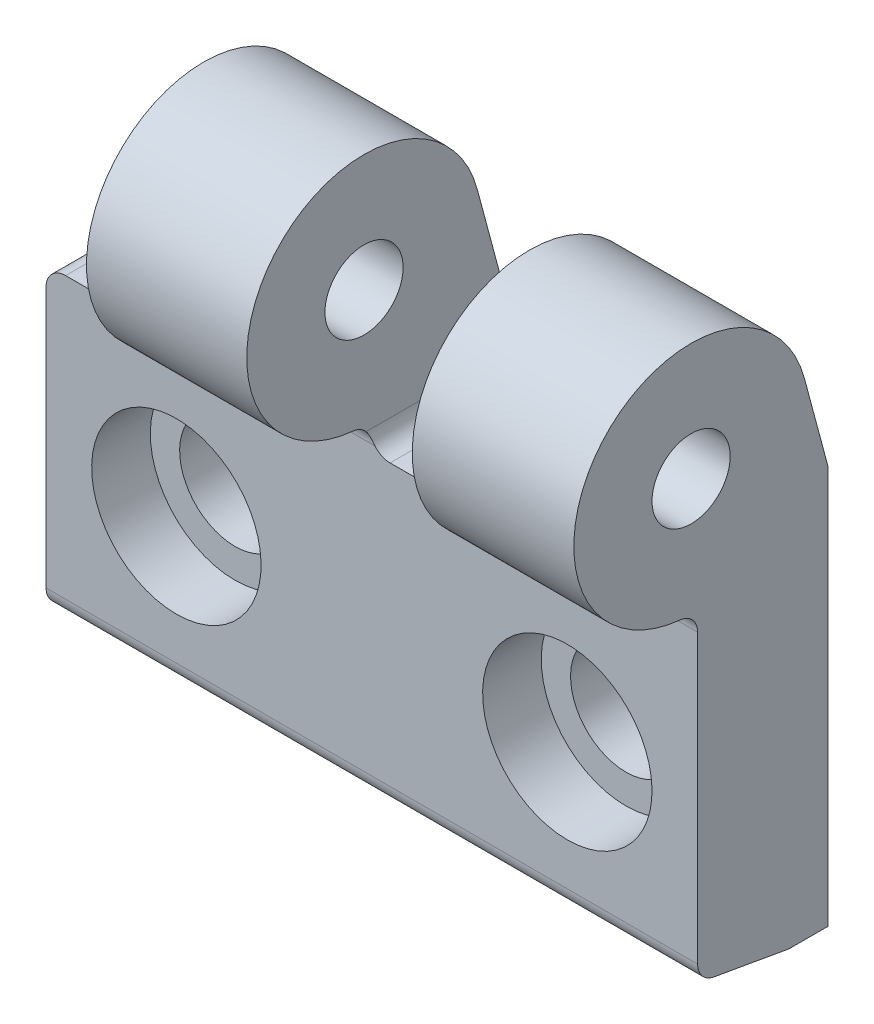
ISO-10303-21;
HEADER;
FILE_DESCRIPTION(('STEP AP214'),'2;1');
FILE_NAME('part.step','',(''),(''),'','','');
FILE_SCHEMA(('AUTOMOTIVE_DESIGN { 1 0 10303 214 1 1 1 1 }'));
ENDSEC;
DATA;
#1=APPLICATION_CONTEXT('core data for automotive mechanical design processes');
#2=APPLICATION_PROTOCOL_DEFINITION('international standard','automotive_design',2000,#1);
#3=PRODUCT_CONTEXT('',#1,'mechanical');
#4=PRODUCT('Part','Part','',(#3));
#5=PRODUCT_RELATED_PRODUCT_CATEGORY('part','',(#4));
#6=PRODUCT_DEFINITION_FORMATION('','',#4);
#7=PRODUCT_DEFINITION_CONTEXT('part definition',#1,'design');
#8=PRODUCT_DEFINITION('design','',#6,#7);
#9=PRODUCT_DEFINITION_SHAPE('','',#8);
#10=(LENGTH_UNIT() NAMED_UNIT(*) SI_UNIT(.MILLI.,.METRE.));
#11=(NAMED_UNIT(*) PLANE_ANGLE_UNIT() SI_UNIT($,.RADIAN.));
#12=(NAMED_UNIT(*) SI_UNIT($,.STERADIAN.) SOLID_ANGLE_UNIT());
#13=UNCERTAINTY_MEASURE_WITH_UNIT(LENGTH_MEASURE(1.E-05),#10,'distance_accuracy_value','');
#14=(GEOMETRIC_REPRESENTATION_CONTEXT(3) GLOBAL_UNCERTAINTY_ASSIGNED_CONTEXT((#13)) GLOBAL_UNIT_ASSIGNED_CONTEXT((#10,
#11,#12)) REPRESENTATION_CONTEXT('',''));
#15=CARTESIAN_POINT('',(0.,0.,0.));
#16=DIRECTION('',(0.,0.,1.));
#17=DIRECTION('',(1.,0.,0.));
#18=AXIS2_PLACEMENT_3D('',#15,#16,#17);
#19=CARTESIAN_POINT('',(40.,22.750000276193,10.5000324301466));
#20=DIRECTION('',(1.,0.,0.));
#21=DIRECTION('',(0.,1.,0.));
#22=AXIS2_PLACEMENT_3D('',#19,#20,#21);
#23=PLANE('',#22);
#24=DIRECTION('',(0.,0.,-1.));
#25=VECTOR('',#24,1.);
#26=CARTESIAN_POINT('',(40.,-12.25,3.));
#27=LINE('',#26,#25);
#28=CARTESIAN_POINT('',(40.,-12.25,3.));
#29=VERTEX_POINT('',#28);
#30=CARTESIAN_POINT('',(40.,-12.25,0.));
#31=VERTEX_POINT('',#30);
#32=EDGE_CURVE('E241',#29,#31,#27,.T.);
#33=ORIENTED_EDGE('',*,*,#32,.T.);
#34=DIRECTION('',(0.,1.,0.));
#35=VECTOR('',#34,1.);
#36=CARTESIAN_POINT('',(40.,-12.25,0.));
#37=LINE('',#36,#35);
#38=CARTESIAN_POINT('',(40.,18.3364567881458,0.));
#39=VERTEX_POINT('',#38);
#40=EDGE_CURVE('E242',#31,#39,#37,.T.);
#41=ORIENTED_EDGE('',*,*,#40,.T.);
#42=DIRECTION('',(0.,0.965927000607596,0.258814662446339));
#43=VECTOR('',#42,1.);
#44=CARTESIAN_POINT('',(40.,18.3364567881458,0.));
#45=LINE('',#44,#43);
#46=CARTESIAN_POINT('',(40.,25.0793174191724,1.806711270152));
#47=VERTEX_POINT('',#46);
#48=EDGE_CURVE('E245',#39,#47,#45,.T.);
#49=ORIENTED_EDGE('',*,*,#48,.T.);
#50=CARTESIAN_POINT('',(40.,22.750000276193,10.5000324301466));
#51=DIRECTION('',(1.,0.,0.));
#52=DIRECTION('',(0.,-1.,0.));
#53=AXIS2_PLACEMENT_3D('',#50,#51,#52);
#54=CIRCLE('',#53,8.99997506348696);
#55=CARTESIAN_POINT('',(40.,13.7909299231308,11.3571260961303));
#56=VERTEX_POINT('',#55);
#57=EDGE_CURVE('E248',#47,#56,#54,.T.);
#58=ORIENTED_EDGE('',*,*,#57,.T.);
#59=CARTESIAN_POINT('',(40.,12.2978016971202,11.499942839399));
#60=DIRECTION('',(-1.,0.,0.));
#61=DIRECTION('',(0.,1.,0.));
#62=AXIS2_PLACEMENT_3D('',#59,#60,#61);
#63=CIRCLE('',#62,1.4999428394);
#64=CARTESIAN_POINT('',(40.,12.2978,10.));
#65=VERTEX_POINT('',#64);
#66=EDGE_CURVE('E251',#56,#65,#63,.T.);
#67=ORIENTED_EDGE('',*,*,#66,.T.);
#68=DIRECTION('',(0.,-1.,0.));
#69=VECTOR('',#68,1.);
#70=CARTESIAN_POINT('',(40.,12.2978,10.));
#71=LINE('',#70,#69);
#72=CARTESIAN_POINT('',(40.,-9.7568,10.));
#73=VERTEX_POINT('',#72);
#74=EDGE_CURVE('E254',#65,#73,#71,.T.);
#75=ORIENTED_EDGE('',*,*,#74,.T.);
#76=CARTESIAN_POINT('',(40.,-9.75672678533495,8.49992708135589));
#77=DIRECTION('',(1.,0.,0.));
#78=DIRECTION('',(0.,1.,0.));
#79=AXIS2_PLACEMENT_3D('',#76,#77,#78);
#80=CIRCLE('',#79,1.50007292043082);
#81=CARTESIAN_POINT('',(40.,-11.233987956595,8.7605382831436));
#82=VERTEX_POINT('',#81);
#83=EDGE_CURVE('E257',#73,#82,#80,.T.);
#84=ORIENTED_EDGE('',*,*,#83,.T.);
#85=DIRECTION('',(0.,-0.173693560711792,-0.984799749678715));
#86=VECTOR('',#85,1.);
#87=CARTESIAN_POINT('',(40.,-11.233987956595,8.7605382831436));
#88=LINE('',#87,#86);
#89=EDGE_CURVE('E260',#82,#29,#88,.T.);
#90=ORIENTED_EDGE('',*,*,#89,.T.);
#91=EDGE_LOOP('',(#33,#41,#49,#58,#67,#75,#84,#90));
#92=FACE_BOUND('',#91,.T.);
#93=CARTESIAN_POINT('',(40.,22.75,10.5));
#94=DIRECTION('',(1.,0.,0.));
#95=DIRECTION('',(0.,1.,0.));
#96=AXIS2_PLACEMENT_3D('',#93,#94,#95);
#97=CIRCLE('',#96,3.);
#98=CARTESIAN_POINT('',(40.,25.75,10.5));
#99=VERTEX_POINT('',#98);
#100=EDGE_CURVE('E317',#99,#99,#97,.T.);
#101=ORIENTED_EDGE('',*,*,#100,.F.);
#102=EDGE_LOOP('',(#101));
#103=FACE_BOUND('',#102,.T.);
#104=ADVANCED_FACE('F14',(#92,#103),#23,.T.);
#105=CARTESIAN_POINT('',(27.6,13.25,35.5));
#106=DIRECTION('',(-1.,0.,0.));
#107=DIRECTION('',(0.,-1.,0.));
#108=AXIS2_PLACEMENT_3D('',#105,#106,#107);
#109=PLANE('',#108);
#110=CARTESIAN_POINT('',(27.6,22.750000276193,10.5000324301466));
#111=DIRECTION('',(-1.,0.,0.));
#112=DIRECTION('',(0.,-1.,0.));
#113=AXIS2_PLACEMENT_3D('',#110,#111,#112);
#114=CIRCLE('',#113,8.99997506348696);
#115=CARTESIAN_POINT('',(27.6,25.0793174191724,1.806711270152));
#116=VERTEX_POINT('',#115);
#117=CARTESIAN_POINT('',(27.6,13.7909299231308,11.3571260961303));
#118=VERTEX_POINT('',#117);
#119=EDGE_CURVE('E233',#116,#118,#114,.F.);
#120=ORIENTED_EDGE('',*,*,#119,.F.);
#121=DIRECTION('',(0.,-0.965927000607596,-0.258814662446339));
#122=VECTOR('',#121,1.);
#123=CARTESIAN_POINT('',(27.6,18.3364567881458,0.));
#124=LINE('',#123,#122);
#125=CARTESIAN_POINT('',(27.6,18.3364567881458,0.));
#126=VERTEX_POINT('',#125);
#127=EDGE_CURVE('E159',#116,#126,#124,.T.);
#128=ORIENTED_EDGE('',*,*,#127,.T.);
#129=DIRECTION('',(0.,-1.,0.));
#130=VECTOR('',#129,1.);
#131=CARTESIAN_POINT('',(27.6,-12.25,0.));
#132=LINE('',#131,#130);
#133=CARTESIAN_POINT('',(27.6,13.25,0.));
#134=VERTEX_POINT('',#133);
#135=EDGE_CURVE('E153',#126,#134,#132,.T.);
#136=ORIENTED_EDGE('',*,*,#135,.T.);
#137=DIRECTION('',(0.,0.,1.));
#138=VECTOR('',#137,1.);
#139=CARTESIAN_POINT('',(27.6,13.25,-14.5));
#140=LINE('',#139,#138);
#141=CARTESIAN_POINT('',(27.6,13.25,10.341000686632));
#142=VERTEX_POINT('',#141);
#143=EDGE_CURVE('E157',#134,#142,#140,.T.);
#144=ORIENTED_EDGE('',*,*,#143,.T.);
#145=CARTESIAN_POINT('',(27.6,12.2978016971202,11.499942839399));
#146=DIRECTION('',(-1.,0.,0.));
#147=DIRECTION('',(0.,-1.,0.));
#148=AXIS2_PLACEMENT_3D('',#145,#146,#147);
#149=CIRCLE('',#148,1.4999428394);
#150=EDGE_CURVE('E294',#118,#142,#149,.T.);
#151=ORIENTED_EDGE('',*,*,#150,.F.);
#152=EDGE_LOOP('',(#120,#128,#136,#144,#151));
#153=FACE_BOUND('',#152,.T.);
#154=CARTESIAN_POINT('',(27.6,22.75,10.5));
#155=DIRECTION('',(-1.,0.,0.));
#156=DIRECTION('',(0.,-1.,0.));
#157=AXIS2_PLACEMENT_3D('',#154,#155,#156);
#158=CIRCLE('',#157,3.);
#159=CARTESIAN_POINT('',(27.6,19.75,10.5));
#160=VERTEX_POINT('',#159);
#161=EDGE_CURVE('E18',#160,#160,#158,.F.);
#162=ORIENTED_EDGE('',*,*,#161,.T.);
#163=EDGE_LOOP('',(#162));
#164=FACE_BOUND('',#163,.T.);
#165=ADVANCED_FACE('F155',(#153,#164),#109,.T.);
#166=CARTESIAN_POINT('',(-10.,22.750000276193,10.5000324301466));
#167=DIRECTION('',(1.,0.,0.));
#168=DIRECTION('',(0.,1.,0.));
#169=AXIS2_PLACEMENT_3D('',#166,#167,#168);
#170=CYLINDRICAL_SURFACE('',#169,8.99997506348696);
#171=DIRECTION('',(1.,0.,0.));
#172=VECTOR('',#171,1.);
#173=CARTESIAN_POINT('',(-10.,25.0793174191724,1.806711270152));
#174=LINE('',#173,#172);
#175=CARTESIAN_POINT('',(2.6,25.0793174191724,1.806711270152));
#176=VERTEX_POINT('',#175);
#177=CARTESIAN_POINT('',(14.9,25.0793174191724,1.806711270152));
#178=VERTEX_POINT('',#177);
#179=EDGE_CURVE('E288',#176,#178,#174,.T.);
#180=ORIENTED_EDGE('',*,*,#179,.F.);
#181=CARTESIAN_POINT('',(2.6,22.750000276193,10.5000324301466));
#182=DIRECTION('',(-1.,0.,0.));
#183=DIRECTION('',(0.,-1.,0.));
#184=AXIS2_PLACEMENT_3D('',#181,#182,#183);
#185=CIRCLE('',#184,8.99997506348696);
#186=CARTESIAN_POINT('',(2.6,13.7909299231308,11.3571260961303));
#187=VERTEX_POINT('',#186);
#188=EDGE_CURVE('E238',#176,#187,#185,.F.);
#189=ORIENTED_EDGE('',*,*,#188,.T.);
#190=DIRECTION('',(1.,0.,0.));
#191=VECTOR('',#190,1.);
#192=CARTESIAN_POINT('',(-10.,13.7909299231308,11.3571260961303));
#193=LINE('',#192,#191);
#194=CARTESIAN_POINT('',(14.9,13.7909299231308,11.3571260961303));
#195=VERTEX_POINT('',#194);
#196=EDGE_CURVE('E285',#187,#195,#193,.T.);
#197=ORIENTED_EDGE('',*,*,#196,.T.);
#198=CARTESIAN_POINT('',(14.9,22.750000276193,10.5000324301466));
#199=DIRECTION('',(1.,0.,0.));
#200=DIRECTION('',(0.,1.,0.));
#201=AXIS2_PLACEMENT_3D('',#198,#199,#200);
#202=CIRCLE('',#201,8.99997506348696);
#203=EDGE_CURVE('E236',#195,#178,#202,.F.);
#204=ORIENTED_EDGE('',*,*,#203,.T.);
#205=EDGE_LOOP('',(#180,#189,#197,#204));
#206=FACE_BOUND('',#205,.T.);
#207=ADVANCED_FACE('F397',(#206),#170,.T.);
#208=CARTESIAN_POINT('',(-10.,12.2978016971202,11.499942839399));
#209=DIRECTION('',(1.,0.,0.));
#210=DIRECTION('',(0.,1.,0.));
#211=AXIS2_PLACEMENT_3D('',#208,#209,#210);
#212=CYLINDRICAL_SURFACE('',#211,1.4999428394);
#213=CARTESIAN_POINT('',(2.25901473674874,12.2978,10.));
#214=CARTESIAN_POINT('',(2.2797627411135,12.3230526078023,10.0000001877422));
#215=CARTESIAN_POINT('',(2.29967758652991,12.3489793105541,10.0006386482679));
#216=CARTESIAN_POINT('',(2.33775095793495,12.4020375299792,10.003389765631));
#217=CARTESIAN_POINT('',(2.35590848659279,12.4291697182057,10.0055032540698));
#218=CARTESIAN_POINT('',(2.40746237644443,12.5119325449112,10.0143326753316));
#219=CARTESIAN_POINT('',(2.43807845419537,12.5690984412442,10.0235349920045));
#220=CARTESIAN_POINT('',(2.49127515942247,12.6856590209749,10.0497775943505));
#221=CARTESIAN_POINT('',(2.51381870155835,12.7450626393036,10.0668532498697));
#222=CARTESIAN_POINT('',(2.55066148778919,12.8634480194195,10.1093233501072));
#223=CARTESIAN_POINT('',(2.56496299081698,12.9224298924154,10.1347155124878));
#224=CARTESIAN_POINT('',(2.58420664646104,13.0275705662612,10.1884093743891));
#225=CARTESIAN_POINT('',(2.59034341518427,13.0741764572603,10.215438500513));
#226=CARTESIAN_POINT('',(2.59825353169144,13.1645032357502,10.2745439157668));
#227=CARTESIAN_POINT('',(2.6000251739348,13.2082229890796,10.3066221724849));
#228=CARTESIAN_POINT('',(2.6,13.25,10.341000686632));
#229=B_SPLINE_CURVE_WITH_KNOTS('',3,(#213,#214,#215,#216,#217,#218,#219,#220,#221,#222,#223,
#224,#225,#226,#227,#228),.UNSPECIFIED.,.F.,.F.,(4,2,2,2,2,2,2,4),(0.,0.0980045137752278,
0.196064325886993,0.391536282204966,0.587895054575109,0.7841999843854,0.946388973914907,
1.10864132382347),.UNSPECIFIED.);
#230=CARTESIAN_POINT('',(2.25901473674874,12.2978,10.));
#231=VERTEX_POINT('',#230);
#232=CARTESIAN_POINT('',(2.6,13.25,10.341000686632));
#233=VERTEX_POINT('',#232);
#234=EDGE_CURVE('E222',#231,#233,#229,.T.);
#235=ORIENTED_EDGE('',*,*,#234,.F.);
#236=DIRECTION('',(1.,0.,0.));
#237=VECTOR('',#236,1.);
#238=CARTESIAN_POINT('',(-10.,12.2978,10.));
#239=LINE('',#238,#237);
#240=CARTESIAN_POINT('',(15.2409852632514,12.2978,10.));
#241=VERTEX_POINT('',#240);
#242=EDGE_CURVE('E282',#231,#241,#239,.T.);
#243=ORIENTED_EDGE('',*,*,#242,.T.);
#244=CARTESIAN_POINT('',(14.9,13.25,10.341000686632));
#245=CARTESIAN_POINT('',(14.9000002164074,13.2247480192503,10.320251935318));
#246=CARTESIAN_POINT('',(14.900638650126,13.1988218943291,10.300336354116));
#247=CARTESIAN_POINT('',(14.9033896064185,13.1457647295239,10.2622615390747));
#248=CARTESIAN_POINT('',(14.9055029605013,13.1186330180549,10.2441033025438));
#249=CARTESIAN_POINT('',(14.9143318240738,13.0358714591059,10.1925473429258));
#250=CARTESIAN_POINT('',(14.9235335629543,12.9787061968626,10.1619299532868));
#251=CARTESIAN_POINT('',(14.9497746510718,12.8621464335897,10.1087308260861));
#252=CARTESIAN_POINT('',(14.9668493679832,12.8027429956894,10.0861861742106));
#253=CARTESIAN_POINT('',(15.0093173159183,12.6843575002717,10.0493414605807));
#254=CARTESIAN_POINT('',(15.0347082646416,12.6253753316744,10.0350391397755));
#255=CARTESIAN_POINT('',(15.0883997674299,12.520233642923,10.0157943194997));
#256=CARTESIAN_POINT('',(15.1154277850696,12.4736271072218,10.0096571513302));
#257=CARTESIAN_POINT('',(15.1745309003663,12.3832987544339,10.0017465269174));
#258=CARTESIAN_POINT('',(15.2066079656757,12.3395780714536,9.99997477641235));
#259=CARTESIAN_POINT('',(15.2409852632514,12.2978,10.));
#260=B_SPLINE_CURVE_WITH_KNOTS('',3,(#244,#245,#246,#247,#248,#249,#250,#251,#252,#253,#254,
#255,#256,#257,#258,#259),.UNSPECIFIED.,.F.,.F.,(4,2,2,2,2,2,2,4),(0.,0.0980044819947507,
0.19606426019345,0.391536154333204,0.587894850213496,0.784199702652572,0.946388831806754,
1.10864132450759),.UNSPECIFIED.);
#261=CARTESIAN_POINT('',(14.9,13.25,10.341000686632));
#262=VERTEX_POINT('',#261);
#263=EDGE_CURVE('E182',#262,#241,#260,.T.);
#264=ORIENTED_EDGE('',*,*,#263,.F.);
#265=CARTESIAN_POINT('',(14.9,12.2978016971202,11.499942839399));
#266=DIRECTION('',(1.,0.,0.));
#267=DIRECTION('',(0.,1.,0.));
#268=AXIS2_PLACEMENT_3D('',#265,#266,#267);
#269=CIRCLE('',#268,1.4999428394);
#270=EDGE_CURVE('E296',#262,#195,#269,.T.);
#271=ORIENTED_EDGE('',*,*,#270,.T.);
#272=ORIENTED_EDGE('',*,*,#196,.F.);
#273=CARTESIAN_POINT('',(2.6,12.2978016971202,11.499942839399));
#274=DIRECTION('',(-1.,0.,0.));
#275=DIRECTION('',(0.,-1.,0.));
#276=AXIS2_PLACEMENT_3D('',#273,#274,#275);
#277=CIRCLE('',#276,1.4999428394);
#278=EDGE_CURVE('E299',#187,#233,#277,.T.);
#279=ORIENTED_EDGE('',*,*,#278,.T.);
#280=EDGE_LOOP('',(#235,#243,#264,#271,#272,#279));
#281=FACE_BOUND('',#280,.T.);
#282=ADVANCED_FACE('F407',(#281),#212,.F.);
#283=CARTESIAN_POINT('',(-10.,18.3364567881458,0.));
#284=DIRECTION('',(0.,0.258814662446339,-0.965927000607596));
#285=DIRECTION('',(0.,0.965927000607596,0.258814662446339));
#286=AXIS2_PLACEMENT_3D('',#283,#284,#285);
#287=PLANE('',#286);
#288=DIRECTION('',(0.,-0.965927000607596,-0.258814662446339));
#289=VECTOR('',#288,1.);
#290=CARTESIAN_POINT('',(2.6,18.3364567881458,0.));
#291=LINE('',#290,#289);
#292=CARTESIAN_POINT('',(2.6,18.3364567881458,0.));
#293=VERTEX_POINT('',#292);
#294=EDGE_CURVE('E350',#176,#293,#291,.T.);
#295=ORIENTED_EDGE('',*,*,#294,.F.);
#296=ORIENTED_EDGE('',*,*,#179,.T.);
#297=DIRECTION('',(0.,0.965927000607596,0.258814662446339));
#298=VECTOR('',#297,1.);
#299=CARTESIAN_POINT('',(14.9,18.3364567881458,0.));
#300=LINE('',#299,#298);
#301=CARTESIAN_POINT('',(14.9,18.3364567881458,0.));
#302=VERTEX_POINT('',#301);
#303=EDGE_CURVE('E163',#302,#178,#300,.T.);
#304=ORIENTED_EDGE('',*,*,#303,.F.);
#305=DIRECTION('',(1.,0.,0.));
#306=VECTOR('',#305,1.);
#307=CARTESIAN_POINT('',(-10.,18.3364567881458,0.));
#308=LINE('',#307,#306);
#309=EDGE_CURVE('E291',#293,#302,#308,.T.);
#310=ORIENTED_EDGE('',*,*,#309,.F.);
#311=EDGE_LOOP('',(#295,#296,#304,#310));
#312=FACE_BOUND('',#311,.T.);
#313=ADVANCED_FACE('F394',(#312),#287,.T.);
#314=EDGE_CURVE('E286',#116,#47,#174,.T.);
#315=ORIENTED_EDGE('',*,*,#314,.F.);
#316=ORIENTED_EDGE('',*,*,#119,.T.);
#317=EDGE_CURVE('E283',#118,#56,#193,.T.);
#318=ORIENTED_EDGE('',*,*,#317,.T.);
#319=ORIENTED_EDGE('',*,*,#57,.F.);
#320=EDGE_LOOP('',(#315,#316,#318,#319));
#321=FACE_BOUND('',#320,.T.);
#322=ADVANCED_FACE('F419',(#321),#170,.T.);
#323=CARTESIAN_POINT('',(27.2590147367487,12.2978,10.));
#324=CARTESIAN_POINT('',(27.2797627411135,12.3230526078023,10.0000001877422));
#325=CARTESIAN_POINT('',(27.2996775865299,12.3489793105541,10.0006386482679));
#326=CARTESIAN_POINT('',(27.3377509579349,12.4020375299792,10.003389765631));
#327=CARTESIAN_POINT('',(27.3559084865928,12.4291697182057,10.0055032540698));
#328=CARTESIAN_POINT('',(27.4074623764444,12.5119325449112,10.0143326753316));
#329=CARTESIAN_POINT('',(27.4380784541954,12.5690984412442,10.0235349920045));
#330=CARTESIAN_POINT('',(27.4912751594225,12.6856590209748,10.0497775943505));
#331=CARTESIAN_POINT('',(27.5138187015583,12.7450626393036,10.0668532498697));
#332=CARTESIAN_POINT('',(27.5506614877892,12.8634480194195,10.1093233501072));
#333=CARTESIAN_POINT('',(27.564962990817,12.9224298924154,10.1347155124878));
#334=CARTESIAN_POINT('',(27.5842066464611,13.0275705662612,10.1884093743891));
#335=CARTESIAN_POINT('',(27.5903434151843,13.0741764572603,10.215438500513));
#336=CARTESIAN_POINT('',(27.5982535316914,13.1645032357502,10.2745439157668));
#337=CARTESIAN_POINT('',(27.6000251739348,13.2082229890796,10.3066221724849));
#338=CARTESIAN_POINT('',(27.6,13.25,10.341000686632));
#339=B_SPLINE_CURVE_WITH_KNOTS('',3,(#323,#324,#325,#326,#327,#328,#329,#330,#331,#332,#333,
#334,#335,#336,#337,#338),.UNSPECIFIED.,.F.,.F.,(4,2,2,2,2,2,2,4),(0.,0.0980045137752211,
0.196064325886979,0.391536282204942,0.587895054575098,0.784199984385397,0.946388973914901,
1.10864132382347),.UNSPECIFIED.);
#340=CARTESIAN_POINT('',(27.2590147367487,12.2978,10.));
#341=VERTEX_POINT('',#340);
#342=EDGE_CURVE('E172',#341,#142,#339,.T.);
#343=ORIENTED_EDGE('',*,*,#342,.F.);
#344=EDGE_CURVE('E280',#341,#65,#239,.T.);
#345=ORIENTED_EDGE('',*,*,#344,.T.);
#346=ORIENTED_EDGE('',*,*,#66,.F.);
#347=ORIENTED_EDGE('',*,*,#317,.F.);
#348=ORIENTED_EDGE('',*,*,#150,.T.);
#349=EDGE_LOOP('',(#343,#345,#346,#347,#348));
#350=FACE_BOUND('',#349,.T.);
#351=ADVANCED_FACE('F202',(#350),#212,.F.);
#352=CARTESIAN_POINT('',(-10.,-12.25,3.));
#353=DIRECTION('',(0.,-1.,0.));
#354=DIRECTION('',(1.,0.,0.));
#355=AXIS2_PLACEMENT_3D('',#352,#353,#354);
#356=PLANE('',#355);
#357=DIRECTION('',(1.,0.,0.));
#358=VECTOR('',#357,1.);
#359=CARTESIAN_POINT('',(-10.,-12.25,0.));
#360=LINE('',#359,#358);
#361=CARTESIAN_POINT('',(-10.,-12.25,0.));
#362=VERTEX_POINT('',#361);
#363=EDGE_CURVE('E292',#362,#31,#360,.T.);
#364=ORIENTED_EDGE('',*,*,#363,.T.);
#365=ORIENTED_EDGE('',*,*,#32,.F.);
#366=DIRECTION('',(1.,0.,0.));
#367=VECTOR('',#366,1.);
#368=CARTESIAN_POINT('',(-10.,-12.25,3.));
#369=LINE('',#368,#367);
#370=CARTESIAN_POINT('',(-10.,-12.25,3.));
#371=VERTEX_POINT('',#370);
#372=EDGE_CURVE('E31',#371,#29,#369,.T.);
#373=ORIENTED_EDGE('',*,*,#372,.F.);
#374=DIRECTION('',(0.,0.,-1.));
#375=VECTOR('',#374,1.);
#376=CARTESIAN_POINT('',(-10.,-12.25,3.));
#377=LINE('',#376,#375);
#378=EDGE_CURVE('E263',#371,#362,#377,.T.);
#379=ORIENTED_EDGE('',*,*,#378,.T.);
#380=EDGE_LOOP('',(#364,#365,#373,#379));
#381=FACE_BOUND('',#380,.T.);
#382=ADVANCED_FACE('F16',(#381),#356,.T.);
#383=CARTESIAN_POINT('',(-10.,-12.25,0.));
#384=DIRECTION('',(0.,0.,-1.));
#385=DIRECTION('',(-1.,0.,0.));
#386=AXIS2_PLACEMENT_3D('',#383,#384,#385);
#387=PLANE('',#386);
#388=CARTESIAN_POINT('',(0.,0.,0.));
#389=DIRECTION('',(0.,0.,1.));
#390=DIRECTION('',(0.,-1.,0.));
#391=AXIS2_PLACEMENT_3D('',#388,#389,#390);
#392=CIRCLE('',#391,4.25);
#393=CARTESIAN_POINT('',(0.,-4.25,0.));
#394=VERTEX_POINT('',#393);
#395=EDGE_CURVE('E959',#394,#394,#392,.T.);
#396=ORIENTED_EDGE('',*,*,#395,.T.);
#397=EDGE_LOOP('',(#396));
#398=FACE_BOUND('',#397,.T.);
#399=CARTESIAN_POINT('',(30.,0.,0.));
#400=DIRECTION('',(0.,0.,1.));
#401=DIRECTION('',(0.,-1.,0.));
#402=AXIS2_PLACEMENT_3D('',#399,#400,#401);
#403=CIRCLE('',#402,4.25);
#404=CARTESIAN_POINT('',(30.,-4.25,0.));
#405=VERTEX_POINT('',#404);
#406=EDGE_CURVE('E972',#405,#405,#403,.T.);
#407=ORIENTED_EDGE('',*,*,#406,.T.);
#408=EDGE_LOOP('',(#407));
#409=FACE_BOUND('',#408,.T.);
#410=CARTESIAN_POINT('',(-8.5010000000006,10.2500000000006,0.));
#411=DIRECTION('',(0.,0.,-1.));
#412=DIRECTION('',(-1.,0.,0.));
#413=AXIS2_PLACEMENT_3D('',#410,#411,#412);
#414=CIRCLE('',#413,1.49999999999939);
#415=CARTESIAN_POINT('',(-8.501,11.75,0.));
#416=VERTEX_POINT('',#415);
#417=CARTESIAN_POINT('',(-10.,10.304763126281,0.));
#418=VERTEX_POINT('',#417);
#419=EDGE_CURVE('E184',#416,#418,#414,.F.);
#420=ORIENTED_EDGE('',*,*,#419,.F.);
#421=DIRECTION('',(-1.,0.,0.));
#422=VECTOR('',#421,1.);
#423=CARTESIAN_POINT('',(-10.,11.75,0.));
#424=LINE('',#423,#422);
#425=CARTESIAN_POINT('',(1.1,11.75,0.));
#426=VERTEX_POINT('',#425);
#427=EDGE_CURVE('E231',#426,#416,#424,.T.);
#428=ORIENTED_EDGE('',*,*,#427,.F.);
#429=CARTESIAN_POINT('',(1.1000000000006,13.2499999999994,0.));
#430=DIRECTION('',(0.,0.,-1.));
#431=DIRECTION('',(-1.,0.,0.));
#432=AXIS2_PLACEMENT_3D('',#429,#430,#431);
#433=CIRCLE('',#432,1.49999999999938);
#434=CARTESIAN_POINT('',(2.6,13.25,0.));
#435=VERTEX_POINT('',#434);
#436=EDGE_CURVE('E229',#435,#426,#433,.T.);
#437=ORIENTED_EDGE('',*,*,#436,.F.);
#438=DIRECTION('',(0.,-1.,0.));
#439=VECTOR('',#438,1.);
#440=CARTESIAN_POINT('',(2.6,-12.25,0.));
#441=LINE('',#440,#439);
#442=EDGE_CURVE('E352',#293,#435,#441,.T.);
#443=ORIENTED_EDGE('',*,*,#442,.F.);
#444=ORIENTED_EDGE('',*,*,#309,.T.);
#445=DIRECTION('',(0.,1.,0.));
#446=VECTOR('',#445,1.);
#447=CARTESIAN_POINT('',(14.9,-12.25,0.));
#448=LINE('',#447,#446);
#449=CARTESIAN_POINT('',(14.9,13.25,0.));
#450=VERTEX_POINT('',#449);
#451=EDGE_CURVE('E348',#450,#302,#448,.T.);
#452=ORIENTED_EDGE('',*,*,#451,.F.);
#453=CARTESIAN_POINT('',(16.3999999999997,13.2499999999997,0.));
#454=DIRECTION('',(0.,0.,-1.));
#455=DIRECTION('',(-1.,0.,0.));
#456=AXIS2_PLACEMENT_3D('',#453,#454,#455);
#457=CIRCLE('',#456,1.49999999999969);
#458=CARTESIAN_POINT('',(16.4,11.75,0.));
#459=VERTEX_POINT('',#458);
#460=EDGE_CURVE('E200',#459,#450,#457,.T.);
#461=ORIENTED_EDGE('',*,*,#460,.F.);
#462=DIRECTION('',(-1.,0.,0.));
#463=VECTOR('',#462,1.);
#464=CARTESIAN_POINT('',(-10.,11.75,0.));
#465=LINE('',#464,#463);
#466=CARTESIAN_POINT('',(26.1,11.75,0.));
#467=VERTEX_POINT('',#466);
#468=EDGE_CURVE('E180',#467,#459,#465,.T.);
#469=ORIENTED_EDGE('',*,*,#468,.F.);
#470=CARTESIAN_POINT('',(26.1000000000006,13.2499999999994,0.));
#471=DIRECTION('',(0.,0.,-1.));
#472=DIRECTION('',(-1.,0.,0.));
#473=AXIS2_PLACEMENT_3D('',#470,#471,#472);
#474=CIRCLE('',#473,1.49999999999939);
#475=EDGE_CURVE('E169',#134,#467,#474,.T.);
#476=ORIENTED_EDGE('',*,*,#475,.F.);
#477=ORIENTED_EDGE('',*,*,#135,.F.);
#478=EDGE_CURVE('E289',#126,#39,#308,.T.);
#479=ORIENTED_EDGE('',*,*,#478,.T.);
#480=ORIENTED_EDGE('',*,*,#40,.F.);
#481=ORIENTED_EDGE('',*,*,#363,.F.);
#482=DIRECTION('',(0.,1.,0.));
#483=VECTOR('',#482,1.);
#484=CARTESIAN_POINT('',(-10.,-12.25,0.));
#485=LINE('',#484,#483);
#486=EDGE_CURVE('E266',#362,#418,#485,.T.);
#487=ORIENTED_EDGE('',*,*,#486,.T.);
#488=EDGE_LOOP('',(#420,#428,#437,#443,#444,#452,#461,#469,#476,#477,#479,#480,#481,#487));
#489=FACE_BOUND('',#488,.T.);
#490=ADVANCED_FACE('F178',(#398,#409,#489),#387,.T.);
#491=ORIENTED_EDGE('',*,*,#127,.F.);
#492=ORIENTED_EDGE('',*,*,#314,.T.);
#493=ORIENTED_EDGE('',*,*,#48,.F.);
#494=ORIENTED_EDGE('',*,*,#478,.F.);
#495=EDGE_LOOP('',(#491,#492,#493,#494));
#496=FACE_BOUND('',#495,.T.);
#497=ADVANCED_FACE('F423',(#496),#287,.T.);
#498=CARTESIAN_POINT('',(-10.,12.2978,10.));
#499=DIRECTION('',(0.,0.,1.));
#500=DIRECTION('',(1.,0.,0.));
#501=AXIS2_PLACEMENT_3D('',#498,#499,#500);
#502=PLANE('',#501);
#503=CARTESIAN_POINT('',(0.,0.,10.));
#504=DIRECTION('',(0.,0.,1.));
#505=DIRECTION('',(0.,-1.,0.));
#506=AXIS2_PLACEMENT_3D('',#503,#504,#505);
#507=CIRCLE('',#506,6.5);
#508=CARTESIAN_POINT('',(0.,-6.5,10.));
#509=VERTEX_POINT('',#508);
#510=EDGE_CURVE('E966',#509,#509,#507,.T.);
#511=ORIENTED_EDGE('',*,*,#510,.F.);
#512=EDGE_LOOP('',(#511));
#513=FACE_BOUND('',#512,.T.);
#514=CARTESIAN_POINT('',(30.,0.,10.));
#515=DIRECTION('',(0.,0.,1.));
#516=DIRECTION('',(0.,-1.,0.));
#517=AXIS2_PLACEMENT_3D('',#514,#515,#516);
#518=CIRCLE('',#517,6.5);
#519=CARTESIAN_POINT('',(30.,-6.5,10.));
#520=VERTEX_POINT('',#519);
#521=EDGE_CURVE('E320',#520,#520,#518,.T.);
#522=ORIENTED_EDGE('',*,*,#521,.F.);
#523=EDGE_LOOP('',(#522));
#524=FACE_BOUND('',#523,.T.);
#525=CARTESIAN_POINT('',(-8.5010000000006,10.2500000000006,10.));
#526=DIRECTION('',(0.,0.,1.));
#527=DIRECTION('',(1.,0.,0.));
#528=AXIS2_PLACEMENT_3D('',#525,#526,#527);
#529=CIRCLE('',#528,1.49999999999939);
#530=CARTESIAN_POINT('',(-10.,10.304763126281,10.));
#531=VERTEX_POINT('',#530);
#532=CARTESIAN_POINT('',(-8.501,11.75,10.));
#533=VERTEX_POINT('',#532);
#534=EDGE_CURVE('E354',#531,#533,#529,.F.);
#535=ORIENTED_EDGE('',*,*,#534,.F.);
#536=DIRECTION('',(0.,-1.,0.));
#537=VECTOR('',#536,1.);
#538=CARTESIAN_POINT('',(-10.,12.2978,10.));
#539=LINE('',#538,#537);
#540=CARTESIAN_POINT('',(-10.,-9.7568,10.));
#541=VERTEX_POINT('',#540);
#542=EDGE_CURVE('E269',#531,#541,#539,.T.);
#543=ORIENTED_EDGE('',*,*,#542,.T.);
#544=DIRECTION('',(1.,0.,0.));
#545=VECTOR('',#544,1.);
#546=CARTESIAN_POINT('',(-10.,-9.7568,10.));
#547=LINE('',#546,#545);
#548=EDGE_CURVE('E278',#541,#73,#547,.T.);
#549=ORIENTED_EDGE('',*,*,#548,.T.);
#550=ORIENTED_EDGE('',*,*,#74,.F.);
#551=ORIENTED_EDGE('',*,*,#344,.F.);
#552=CARTESIAN_POINT('',(26.1000000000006,13.2499999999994,10.));
#553=DIRECTION('',(0.,0.,1.));
#554=DIRECTION('',(1.,0.,0.));
#555=AXIS2_PLACEMENT_3D('',#552,#553,#554);
#556=CIRCLE('',#555,1.49999999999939);
#557=CARTESIAN_POINT('',(26.1,11.75,10.));
#558=VERTEX_POINT('',#557);
#559=EDGE_CURVE('E304',#558,#341,#556,.T.);
#560=ORIENTED_EDGE('',*,*,#559,.F.);
#561=DIRECTION('',(1.,0.,0.));
#562=VECTOR('',#561,1.);
#563=CARTESIAN_POINT('',(-10.,11.75,10.));
#564=LINE('',#563,#562);
#565=CARTESIAN_POINT('',(16.4,11.75,10.));
#566=VERTEX_POINT('',#565);
#567=EDGE_CURVE('E306',#566,#558,#564,.T.);
#568=ORIENTED_EDGE('',*,*,#567,.F.);
#569=CARTESIAN_POINT('',(16.3999999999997,13.2499999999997,10.));
#570=DIRECTION('',(0.,0.,1.));
#571=DIRECTION('',(1.,0.,0.));
#572=AXIS2_PLACEMENT_3D('',#569,#570,#571);
#573=CIRCLE('',#572,1.49999999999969);
#574=EDGE_CURVE('E308',#241,#566,#573,.T.);
#575=ORIENTED_EDGE('',*,*,#574,.F.);
#576=ORIENTED_EDGE('',*,*,#242,.F.);
#577=CARTESIAN_POINT('',(1.1000000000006,13.2499999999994,10.));
#578=DIRECTION('',(0.,0.,1.));
#579=DIRECTION('',(1.,0.,0.));
#580=AXIS2_PLACEMENT_3D('',#577,#578,#579);
#581=CIRCLE('',#580,1.49999999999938);
#582=CARTESIAN_POINT('',(1.1,11.75,10.));
#583=VERTEX_POINT('',#582);
#584=EDGE_CURVE('E23',#583,#231,#581,.T.);
#585=ORIENTED_EDGE('',*,*,#584,.F.);
#586=DIRECTION('',(1.,0.,0.));
#587=VECTOR('',#586,1.);
#588=CARTESIAN_POINT('',(-10.,11.75,10.));
#589=LINE('',#588,#587);
#590=EDGE_CURVE('E9',#533,#583,#589,.T.);
#591=ORIENTED_EDGE('',*,*,#590,.F.);
#592=EDGE_LOOP('',(#535,#543,#549,#550,#551,#560,#568,#575,#576,#585,#591));
#593=FACE_BOUND('',#592,.T.);
#594=ADVANCED_FACE('F376',(#513,#524,#593),#502,.T.);
#595=CARTESIAN_POINT('',(-10.,-9.75672678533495,8.49992708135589));
#596=DIRECTION('',(1.,0.,0.));
#597=DIRECTION('',(0.,1.,0.));
#598=AXIS2_PLACEMENT_3D('',#595,#596,#597);
#599=CYLINDRICAL_SURFACE('',#598,1.50007292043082);
#600=DIRECTION('',(1.,0.,0.));
#601=VECTOR('',#600,1.);
#602=CARTESIAN_POINT('',(-10.,-11.233987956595,8.7605382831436));
#603=LINE('',#602,#601);
#604=CARTESIAN_POINT('',(-10.,-11.233987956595,8.7605382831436));
#605=VERTEX_POINT('',#604);
#606=EDGE_CURVE('E38',#605,#82,#603,.T.);
#607=ORIENTED_EDGE('',*,*,#606,.T.);
#608=ORIENTED_EDGE('',*,*,#83,.F.);
#609=ORIENTED_EDGE('',*,*,#548,.F.);
#610=CARTESIAN_POINT('',(-10.,-9.75672678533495,8.49992708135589));
#611=DIRECTION('',(1.,0.,0.));
#612=DIRECTION('',(0.,1.,0.));
#613=AXIS2_PLACEMENT_3D('',#610,#611,#612);
#614=CIRCLE('',#613,1.50007292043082);
#615=EDGE_CURVE('E271',#541,#605,#614,.T.);
#616=ORIENTED_EDGE('',*,*,#615,.T.);
#617=EDGE_LOOP('',(#607,#608,#609,#616));
#618=FACE_BOUND('',#617,.T.);
#619=ADVANCED_FACE('F374',(#618),#599,.T.);
#620=CARTESIAN_POINT('',(-10.,-11.233987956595,8.7605382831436));
#621=DIRECTION('',(0.,-0.984799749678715,0.173693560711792));
#622=DIRECTION('',(0.,-0.173693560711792,-0.984799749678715));
#623=AXIS2_PLACEMENT_3D('',#620,#621,#622);
#624=PLANE('',#623);
#625=ORIENTED_EDGE('',*,*,#372,.T.);
#626=ORIENTED_EDGE('',*,*,#89,.F.);
#627=ORIENTED_EDGE('',*,*,#606,.F.);
#628=DIRECTION('',(0.,-0.173693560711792,-0.984799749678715));
#629=VECTOR('',#628,1.);
#630=CARTESIAN_POINT('',(-10.,-11.233987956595,8.7605382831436));
#631=LINE('',#630,#629);
#632=EDGE_CURVE('E273',#605,#371,#631,.T.);
#633=ORIENTED_EDGE('',*,*,#632,.T.);
#634=EDGE_LOOP('',(#625,#626,#627,#633));
#635=FACE_BOUND('',#634,.T.);
#636=ADVANCED_FACE('F367',(#635),#624,.T.);
#637=CARTESIAN_POINT('',(-10.,22.750000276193,10.5000324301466));
#638=DIRECTION('',(1.,0.,0.));
#639=DIRECTION('',(0.,1.,0.));
#640=AXIS2_PLACEMENT_3D('',#637,#638,#639);
#641=PLANE('',#640);
#642=ORIENTED_EDGE('',*,*,#542,.F.);
#643=DIRECTION('',(0.,0.,1.));
#644=VECTOR('',#643,1.);
#645=CARTESIAN_POINT('',(-10.,10.304763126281,-14.5));
#646=LINE('',#645,#644);
#647=EDGE_CURVE('E301',#531,#418,#646,.F.);
#648=ORIENTED_EDGE('',*,*,#647,.T.);
#649=ORIENTED_EDGE('',*,*,#486,.F.);
#650=ORIENTED_EDGE('',*,*,#378,.F.);
#651=ORIENTED_EDGE('',*,*,#632,.F.);
#652=ORIENTED_EDGE('',*,*,#615,.F.);
#653=EDGE_LOOP('',(#642,#648,#649,#650,#651,#652));
#654=FACE_BOUND('',#653,.T.);
#655=ADVANCED_FACE('F362',(#654),#641,.F.);
#656=CARTESIAN_POINT('',(2.6,13.25,35.5));
#657=DIRECTION('',(-1.,0.,0.));
#658=DIRECTION('',(0.,-1.,0.));
#659=AXIS2_PLACEMENT_3D('',#656,#657,#658);
#660=PLANE('',#659);
#661=CARTESIAN_POINT('',(2.6,22.75,10.5));
#662=DIRECTION('',(-1.,0.,0.));
#663=DIRECTION('',(0.,-1.,0.));
#664=AXIS2_PLACEMENT_3D('',#661,#662,#663);
#665=CIRCLE('',#664,3.);
#666=CARTESIAN_POINT('',(2.6,19.75,10.5));
#667=VERTEX_POINT('',#666);
#668=EDGE_CURVE('E174',#667,#667,#665,.T.);
#669=ORIENTED_EDGE('',*,*,#668,.F.);
#670=EDGE_LOOP('',(#669));
#671=FACE_BOUND('',#670,.T.);
#672=ORIENTED_EDGE('',*,*,#188,.F.);
#673=ORIENTED_EDGE('',*,*,#294,.T.);
#674=ORIENTED_EDGE('',*,*,#442,.T.);
#675=DIRECTION('',(0.,0.,1.));
#676=VECTOR('',#675,1.);
#677=CARTESIAN_POINT('',(2.6,13.25,-14.5));
#678=LINE('',#677,#676);
#679=EDGE_CURVE('E336',#435,#233,#678,.T.);
#680=ORIENTED_EDGE('',*,*,#679,.T.);
#681=ORIENTED_EDGE('',*,*,#278,.F.);
#682=EDGE_LOOP('',(#672,#673,#674,#680,#681));
#683=FACE_BOUND('',#682,.T.);
#684=ADVANCED_FACE('F389',(#671,#683),#660,.T.);
#685=CARTESIAN_POINT('',(14.9,31.751,35.5));
#686=DIRECTION('',(1.,0.,0.));
#687=DIRECTION('',(0.,1.,0.));
#688=AXIS2_PLACEMENT_3D('',#685,#686,#687);
#689=PLANE('',#688);
#690=CARTESIAN_POINT('',(14.9,22.75,10.5));
#691=DIRECTION('',(1.,0.,0.));
#692=DIRECTION('',(0.,1.,0.));
#693=AXIS2_PLACEMENT_3D('',#690,#691,#692);
#694=CIRCLE('',#693,3.);
#695=CARTESIAN_POINT('',(14.9,25.75,10.5));
#696=VERTEX_POINT('',#695);
#697=EDGE_CURVE('E310',#696,#696,#694,.T.);
#698=ORIENTED_EDGE('',*,*,#697,.F.);
#699=EDGE_LOOP('',(#698));
#700=FACE_BOUND('',#699,.T.);
#701=ORIENTED_EDGE('',*,*,#270,.F.);
#702=DIRECTION('',(0.,0.,1.));
#703=VECTOR('',#702,1.);
#704=CARTESIAN_POINT('',(14.9,13.25,-14.5));
#705=LINE('',#704,#703);
#706=EDGE_CURVE('E333',#450,#262,#705,.T.);
#707=ORIENTED_EDGE('',*,*,#706,.F.);
#708=ORIENTED_EDGE('',*,*,#451,.T.);
#709=ORIENTED_EDGE('',*,*,#303,.T.);
#710=ORIENTED_EDGE('',*,*,#203,.F.);
#711=EDGE_LOOP('',(#701,#707,#708,#709,#710));
#712=FACE_BOUND('',#711,.T.);
#713=ADVANCED_FACE('F401',(#700,#712),#689,.T.);
#714=CARTESIAN_POINT('',(26.1000000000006,13.2499999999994,-14.5));
#715=DIRECTION('',(0.,0.,1.));
#716=DIRECTION('',(1.,0.,0.));
#717=AXIS2_PLACEMENT_3D('',#714,#715,#716);
#718=CYLINDRICAL_SURFACE('',#717,1.49999999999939);
#719=ORIENTED_EDGE('',*,*,#475,.T.);
#720=DIRECTION('',(0.,0.,1.));
#721=VECTOR('',#720,1.);
#722=CARTESIAN_POINT('',(26.1,11.75,-14.5));
#723=LINE('',#722,#721);
#724=EDGE_CURVE('E173',#467,#558,#723,.T.);
#725=ORIENTED_EDGE('',*,*,#724,.T.);
#726=ORIENTED_EDGE('',*,*,#559,.T.);
#727=ORIENTED_EDGE('',*,*,#342,.T.);
#728=ORIENTED_EDGE('',*,*,#143,.F.);
#729=EDGE_LOOP('',(#719,#725,#726,#727,#728));
#730=FACE_BOUND('',#729,.T.);
#731=ADVANCED_FACE('F167',(#730),#718,.F.);
#732=CARTESIAN_POINT('',(16.4,11.75,-14.5));
#733=DIRECTION('',(0.,-1.,0.));
#734=DIRECTION('',(1.,0.,0.));
#735=AXIS2_PLACEMENT_3D('',#732,#733,#734);
#736=PLANE('',#735);
#737=ORIENTED_EDGE('',*,*,#468,.T.);
#738=DIRECTION('',(0.,0.,1.));
#739=VECTOR('',#738,1.);
#740=CARTESIAN_POINT('',(16.4,11.75,-14.5));
#741=LINE('',#740,#739);
#742=EDGE_CURVE('E330',#459,#566,#741,.T.);
#743=ORIENTED_EDGE('',*,*,#742,.T.);
#744=ORIENTED_EDGE('',*,*,#567,.T.);
#745=ORIENTED_EDGE('',*,*,#724,.F.);
#746=EDGE_LOOP('',(#737,#743,#744,#745));
#747=FACE_BOUND('',#746,.T.);
#748=ADVANCED_FACE('F212',(#747),#736,.F.);
#749=CARTESIAN_POINT('',(16.3999999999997,13.2499999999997,-14.5));
#750=DIRECTION('',(0.,0.,1.));
#751=DIRECTION('',(1.,0.,0.));
#752=AXIS2_PLACEMENT_3D('',#749,#750,#751);
#753=CYLINDRICAL_SURFACE('',#752,1.49999999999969);
#754=ORIENTED_EDGE('',*,*,#460,.T.);
#755=ORIENTED_EDGE('',*,*,#706,.T.);
#756=ORIENTED_EDGE('',*,*,#263,.T.);
#757=ORIENTED_EDGE('',*,*,#574,.T.);
#758=ORIENTED_EDGE('',*,*,#742,.F.);
#759=EDGE_LOOP('',(#754,#755,#756,#757,#758));
#760=FACE_BOUND('',#759,.T.);
#761=ADVANCED_FACE('F206',(#760),#753,.F.);
#762=CARTESIAN_POINT('',(-8.5010000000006,10.2500000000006,-14.5));
#763=DIRECTION('',(0.,0.,1.));
#764=DIRECTION('',(1.,0.,0.));
#765=AXIS2_PLACEMENT_3D('',#762,#763,#764);
#766=CYLINDRICAL_SURFACE('',#765,1.49999999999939);
#767=ORIENTED_EDGE('',*,*,#419,.T.);
#768=ORIENTED_EDGE('',*,*,#647,.F.);
#769=ORIENTED_EDGE('',*,*,#534,.T.);
#770=DIRECTION('',(0.,0.,1.));
#771=VECTOR('',#770,1.);
#772=CARTESIAN_POINT('',(-8.501,11.75,-14.5));
#773=LINE('',#772,#771);
#774=EDGE_CURVE('E342',#416,#533,#773,.T.);
#775=ORIENTED_EDGE('',*,*,#774,.F.);
#776=EDGE_LOOP('',(#767,#768,#769,#775));
#777=FACE_BOUND('',#776,.T.);
#778=ADVANCED_FACE('F211',(#777),#766,.T.);
#779=CARTESIAN_POINT('',(-8.501,11.75,-14.5));
#780=DIRECTION('',(0.,-1.,0.));
#781=DIRECTION('',(1.,0.,0.));
#782=AXIS2_PLACEMENT_3D('',#779,#780,#781);
#783=PLANE('',#782);
#784=ORIENTED_EDGE('',*,*,#427,.T.);
#785=ORIENTED_EDGE('',*,*,#774,.T.);
#786=ORIENTED_EDGE('',*,*,#590,.T.);
#787=DIRECTION('',(0.,0.,1.));
#788=VECTOR('',#787,1.);
#789=CARTESIAN_POINT('',(1.1,11.75,-14.5));
#790=LINE('',#789,#788);
#791=EDGE_CURVE('E339',#426,#583,#790,.T.);
#792=ORIENTED_EDGE('',*,*,#791,.F.);
#793=EDGE_LOOP('',(#784,#785,#786,#792));
#794=FACE_BOUND('',#793,.T.);
#795=ADVANCED_FACE('F219',(#794),#783,.F.);
#796=CARTESIAN_POINT('',(1.1000000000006,13.2499999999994,-14.5));
#797=DIRECTION('',(0.,0.,1.));
#798=DIRECTION('',(1.,0.,0.));
#799=AXIS2_PLACEMENT_3D('',#796,#797,#798);
#800=CYLINDRICAL_SURFACE('',#799,1.49999999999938);
#801=ORIENTED_EDGE('',*,*,#436,.T.);
#802=ORIENTED_EDGE('',*,*,#791,.T.);
#803=ORIENTED_EDGE('',*,*,#584,.T.);
#804=ORIENTED_EDGE('',*,*,#234,.T.);
#805=ORIENTED_EDGE('',*,*,#679,.F.);
#806=EDGE_LOOP('',(#801,#802,#803,#804,#805));
#807=FACE_BOUND('',#806,.T.);
#808=ADVANCED_FACE('F214',(#807),#800,.F.);
#809=CARTESIAN_POINT('',(-10.,22.75,10.5));
#810=DIRECTION('',(1.,0.,0.));
#811=DIRECTION('',(0.,1.,0.));
#812=AXIS2_PLACEMENT_3D('',#809,#810,#811);
#813=CYLINDRICAL_SURFACE('',#812,3.);
#814=ORIENTED_EDGE('',*,*,#668,.T.);
#815=EDGE_LOOP('',(#814));
#816=FACE_BOUND('',#815,.T.);
#817=ORIENTED_EDGE('',*,*,#697,.T.);
#818=EDGE_LOOP('',(#817));
#819=FACE_BOUND('',#818,.T.);
#820=ADVANCED_FACE('F218',(#816,#819),#813,.F.);
#821=CARTESIAN_POINT('',(40.,22.75,10.5));
#822=DIRECTION('',(-1.,0.,0.));
#823=DIRECTION('',(0.,-1.,0.));
#824=AXIS2_PLACEMENT_3D('',#821,#822,#823);
#825=CYLINDRICAL_SURFACE('',#824,3.);
#826=ORIENTED_EDGE('',*,*,#161,.F.);
#827=EDGE_LOOP('',(#826));
#828=FACE_BOUND('',#827,.T.);
#829=ORIENTED_EDGE('',*,*,#100,.T.);
#830=EDGE_LOOP('',(#829));
#831=FACE_BOUND('',#830,.T.);
#832=ADVANCED_FACE('F525',(#828,#831),#825,.F.);
#833=CARTESIAN_POINT('',(30.,0.,0.));
#834=DIRECTION('',(0.,0.,1.));
#835=DIRECTION('',(0.,-1.,0.));
#836=AXIS2_PLACEMENT_3D('',#833,#834,#835);
#837=CYLINDRICAL_SURFACE('',#836,6.5);
#838=CARTESIAN_POINT('',(30.,0.,5.5));
#839=DIRECTION('',(0.,0.,1.));
#840=DIRECTION('',(0.,-1.,0.));
#841=AXIS2_PLACEMENT_3D('',#838,#839,#840);
#842=CIRCLE('',#841,6.5);
#843=CARTESIAN_POINT('',(30.,-6.5,5.5));
#844=VERTEX_POINT('',#843);
#845=EDGE_CURVE('E325',#844,#844,#842,.T.);
#846=ORIENTED_EDGE('',*,*,#845,.F.);
#847=EDGE_LOOP('',(#846));
#848=FACE_BOUND('',#847,.T.);
#849=ORIENTED_EDGE('',*,*,#521,.T.);
#850=EDGE_LOOP('',(#849));
#851=FACE_BOUND('',#850,.T.);
#852=ADVANCED_FACE('F534',(#848,#851),#837,.F.);
#853=CARTESIAN_POINT('',(23.5,0.,5.5));
#854=DIRECTION('',(0.,0.,-1.));
#855=DIRECTION('',(0.,1.,0.));
#856=AXIS2_PLACEMENT_3D('',#853,#854,#855);
#857=PLANE('',#856);
#858=CARTESIAN_POINT('',(30.,0.,5.5));
#859=DIRECTION('',(0.,0.,1.));
#860=DIRECTION('',(0.,-1.,0.));
#861=AXIS2_PLACEMENT_3D('',#858,#859,#860);
#862=CIRCLE('',#861,4.25);
#863=CARTESIAN_POINT('',(30.,-4.25,5.5));
#864=VERTEX_POINT('',#863);
#865=EDGE_CURVE('E975',#864,#864,#862,.T.);
#866=ORIENTED_EDGE('',*,*,#865,.F.);
#867=EDGE_LOOP('',(#866));
#868=FACE_BOUND('',#867,.T.);
#869=ORIENTED_EDGE('',*,*,#845,.T.);
#870=EDGE_LOOP('',(#869));
#871=FACE_BOUND('',#870,.T.);
#872=ADVANCED_FACE('F543',(#868,#871),#857,.F.);
#873=CARTESIAN_POINT('',(30.,0.,0.));
#874=DIRECTION('',(0.,0.,1.));
#875=DIRECTION('',(0.,-1.,0.));
#876=AXIS2_PLACEMENT_3D('',#873,#874,#875);
#877=CYLINDRICAL_SURFACE('',#876,4.25);
#878=ORIENTED_EDGE('',*,*,#406,.F.);
#879=EDGE_LOOP('',(#878));
#880=FACE_BOUND('',#879,.T.);
#881=ORIENTED_EDGE('',*,*,#865,.T.);
#882=EDGE_LOOP('',(#881));
#883=FACE_BOUND('',#882,.T.);
#884=ADVANCED_FACE('F552',(#880,#883),#877,.F.);
#885=CARTESIAN_POINT('',(0.,0.,0.));
#886=DIRECTION('',(0.,0.,1.));
#887=DIRECTION('',(0.,-1.,0.));
#888=AXIS2_PLACEMENT_3D('',#885,#886,#887);
#889=CYLINDRICAL_SURFACE('',#888,6.5);
#890=CARTESIAN_POINT('',(0.,0.,5.5));
#891=DIRECTION('',(0.,0.,1.));
#892=DIRECTION('',(0.,-1.,0.));
#893=AXIS2_PLACEMENT_3D('',#890,#891,#892);
#894=CIRCLE('',#893,6.5);
#895=CARTESIAN_POINT('',(0.,-6.5,5.5));
#896=VERTEX_POINT('',#895);
#897=EDGE_CURVE('E963',#896,#896,#894,.T.);
#898=ORIENTED_EDGE('',*,*,#897,.F.);
#899=EDGE_LOOP('',(#898));
#900=FACE_BOUND('',#899,.T.);
#901=ORIENTED_EDGE('',*,*,#510,.T.);
#902=EDGE_LOOP('',(#901));
#903=FACE_BOUND('',#902,.T.);
#904=ADVANCED_FACE('F561',(#900,#903),#889,.F.);
#905=CARTESIAN_POINT('',(-6.5,0.,5.5));
#906=DIRECTION('',(0.,0.,-1.));
#907=DIRECTION('',(0.,1.,0.));
#908=AXIS2_PLACEMENT_3D('',#905,#906,#907);
#909=PLANE('',#908);
#910=CARTESIAN_POINT('',(0.,0.,5.5));
#911=DIRECTION('',(0.,0.,1.));
#912=DIRECTION('',(0.,-1.,0.));
#913=AXIS2_PLACEMENT_3D('',#910,#911,#912);
#914=CIRCLE('',#913,4.25);
#915=CARTESIAN_POINT('',(0.,-4.25,5.5));
#916=VERTEX_POINT('',#915);
#917=EDGE_CURVE('E962',#916,#916,#914,.T.);
#918=ORIENTED_EDGE('',*,*,#917,.F.);
#919=EDGE_LOOP('',(#918));
#920=FACE_BOUND('',#919,.T.);
#921=ORIENTED_EDGE('',*,*,#897,.T.);
#922=EDGE_LOOP('',(#921));
#923=FACE_BOUND('',#922,.T.);
#924=ADVANCED_FACE('F570',(#920,#923),#909,.F.);
#925=CARTESIAN_POINT('',(0.,0.,0.));
#926=DIRECTION('',(0.,0.,1.));
#927=DIRECTION('',(0.,-1.,0.));
#928=AXIS2_PLACEMENT_3D('',#925,#926,#927);
#929=CYLINDRICAL_SURFACE('',#928,4.25);
#930=ORIENTED_EDGE('',*,*,#395,.F.);
#931=EDGE_LOOP('',(#930));
#932=FACE_BOUND('',#931,.T.);
#933=ORIENTED_EDGE('',*,*,#917,.T.);
#934=EDGE_LOOP('',(#933));
#935=FACE_BOUND('',#934,.T.);
#936=ADVANCED_FACE('F579',(#932,#935),#929,.F.);
#937=CLOSED_SHELL('',(#104,#165,#207,#282,#313,#322,#351,#382,#490,#497,#594,#619,#636,#655,
#684,#713,#731,#748,#761,#778,#795,#808,#820,#832,#852,#872,#884,#904,#924,#936));
#938=MANIFOLD_SOLID_BREP('B1',#937);
#939=ADVANCED_BREP_SHAPE_REPRESENTATION('',(#18,#938),#14);
#940=SHAPE_DEFINITION_REPRESENTATION(#9,#939);
ENDSEC;
END-ISO-10303-21;
